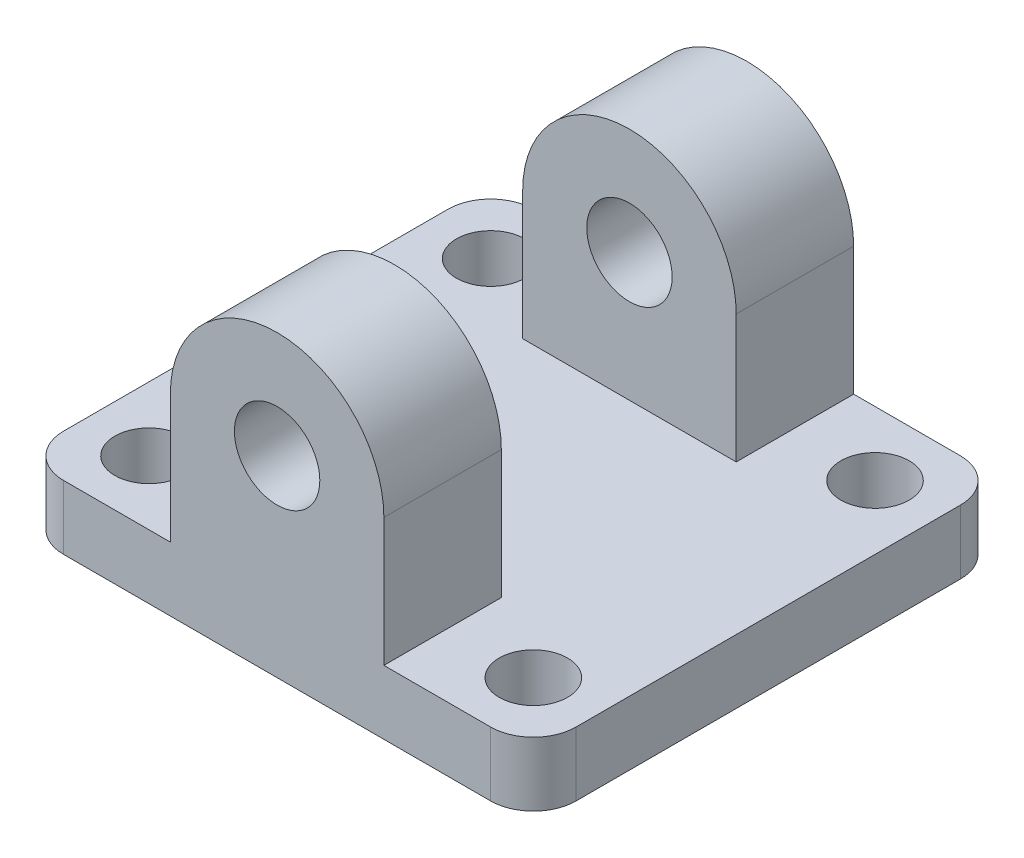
ISO-10303-21;
HEADER;
FILE_DESCRIPTION(('STEP AP214'),'2;1');
FILE_NAME('part.step','',(''),(''),'','','');
FILE_SCHEMA(('AUTOMOTIVE_DESIGN { 1 0 10303 214 1 1 1 1 }'));
ENDSEC;
DATA;
#1=APPLICATION_CONTEXT('core data for automotive mechanical design processes');
#2=APPLICATION_PROTOCOL_DEFINITION('international standard','automotive_design',2000,#1);
#3=PRODUCT_CONTEXT('',#1,'mechanical');
#4=PRODUCT('Part','Part','',(#3));
#5=PRODUCT_RELATED_PRODUCT_CATEGORY('part','',(#4));
#6=PRODUCT_DEFINITION_FORMATION('','',#4);
#7=PRODUCT_DEFINITION_CONTEXT('part definition',#1,'design');
#8=PRODUCT_DEFINITION('design','',#6,#7);
#9=PRODUCT_DEFINITION_SHAPE('','',#8);
#10=(LENGTH_UNIT() NAMED_UNIT(*) SI_UNIT(.MILLI.,.METRE.));
#11=(NAMED_UNIT(*) PLANE_ANGLE_UNIT() SI_UNIT($,.RADIAN.));
#12=(NAMED_UNIT(*) SI_UNIT($,.STERADIAN.) SOLID_ANGLE_UNIT());
#13=UNCERTAINTY_MEASURE_WITH_UNIT(LENGTH_MEASURE(1.E-05),#10,'distance_accuracy_value','');
#14=(GEOMETRIC_REPRESENTATION_CONTEXT(3) GLOBAL_UNCERTAINTY_ASSIGNED_CONTEXT((#13)) GLOBAL_UNIT_ASSIGNED_CONTEXT((#10,
#11,#12)) REPRESENTATION_CONTEXT('',''));
#15=CARTESIAN_POINT('',(0.,0.,0.));
#16=DIRECTION('',(0.,0.,1.));
#17=DIRECTION('',(1.,0.,0.));
#18=AXIS2_PLACEMENT_3D('',#15,#16,#17);
#19=CARTESIAN_POINT('',(5.,3.,22.));
#20=DIRECTION('',(-1.,0.,0.));
#21=DIRECTION('',(0.,-1.,0.));
#22=AXIS2_PLACEMENT_3D('',#19,#20,#21);
#23=PLANE('',#22);
#24=DIRECTION('',(0.,1.,0.));
#25=VECTOR('',#24,1.);
#26=CARTESIAN_POINT('',(5.,3.,5.5));
#27=LINE('',#26,#25);
#28=CARTESIAN_POINT('',(5.,3.,5.5));
#29=VERTEX_POINT('',#28);
#30=CARTESIAN_POINT('',(5.,9.,5.5));
#31=VERTEX_POINT('',#30);
#32=EDGE_CURVE('E237',#29,#31,#27,.T.);
#33=ORIENTED_EDGE('',*,*,#32,.F.);
#34=DIRECTION('',(0.,0.,-1.));
#35=VECTOR('',#34,1.);
#36=CARTESIAN_POINT('',(5.,3.,22.));
#37=LINE('',#36,#35);
#38=CARTESIAN_POINT('',(5.,3.,0.));
#39=VERTEX_POINT('',#38);
#40=EDGE_CURVE('E177',#29,#39,#37,.T.);
#41=ORIENTED_EDGE('',*,*,#40,.T.);
#42=DIRECTION('',(0.,1.,0.));
#43=VECTOR('',#42,1.);
#44=CARTESIAN_POINT('',(5.,3.,0.));
#45=LINE('',#44,#43);
#46=CARTESIAN_POINT('',(5.,9.,0.));
#47=VERTEX_POINT('',#46);
#48=EDGE_CURVE('E277',#39,#47,#45,.T.);
#49=ORIENTED_EDGE('',*,*,#48,.T.);
#50=DIRECTION('',(0.,0.,-1.));
#51=VECTOR('',#50,1.);
#52=CARTESIAN_POINT('',(5.,9.,22.));
#53=LINE('',#52,#51);
#54=EDGE_CURVE('E261',#31,#47,#53,.T.);
#55=ORIENTED_EDGE('',*,*,#54,.F.);
#56=EDGE_LOOP('',(#33,#41,#49,#55));
#57=FACE_BOUND('',#56,.T.);
#58=ADVANCED_FACE('F34',(#57),#23,.F.);
#59=CARTESIAN_POINT('',(0.,9.,22.));
#60=DIRECTION('',(0.,0.,-1.));
#61=DIRECTION('',(-1.,0.,0.));
#62=AXIS2_PLACEMENT_3D('',#59,#60,#61);
#63=CYLINDRICAL_SURFACE('',#62,5.);
#64=DIRECTION('',(0.,0.,-1.));
#65=VECTOR('',#64,1.);
#66=CARTESIAN_POINT('',(-5.,9.,22.));
#67=LINE('',#66,#65);
#68=CARTESIAN_POINT('',(-5.,9.,5.5));
#69=VERTEX_POINT('',#68);
#70=CARTESIAN_POINT('',(-5.,9.,0.));
#71=VERTEX_POINT('',#70);
#72=EDGE_CURVE('E258',#69,#71,#67,.T.);
#73=ORIENTED_EDGE('',*,*,#72,.F.);
#74=CARTESIAN_POINT('',(0.,9.,5.5));
#75=DIRECTION('',(0.,0.,1.));
#76=DIRECTION('',(0.,-1.,0.));
#77=AXIS2_PLACEMENT_3D('',#74,#75,#76);
#78=CIRCLE('',#77,5.);
#79=EDGE_CURVE('E290',#31,#69,#78,.T.);
#80=ORIENTED_EDGE('',*,*,#79,.F.);
#81=ORIENTED_EDGE('',*,*,#54,.T.);
#82=CARTESIAN_POINT('',(0.,9.,0.));
#83=DIRECTION('',(0.,0.,1.));
#84=DIRECTION('',(1.,0.,0.));
#85=AXIS2_PLACEMENT_3D('',#82,#83,#84);
#86=CIRCLE('',#85,5.);
#87=EDGE_CURVE('E252',#47,#71,#86,.T.);
#88=ORIENTED_EDGE('',*,*,#87,.T.);
#89=EDGE_LOOP('',(#73,#80,#81,#88));
#90=FACE_BOUND('',#89,.T.);
#91=ADVANCED_FACE('F273',(#90),#63,.T.);
#92=CARTESIAN_POINT('',(-5.,9.,22.));
#93=DIRECTION('',(1.,0.,0.));
#94=DIRECTION('',(0.,1.,0.));
#95=AXIS2_PLACEMENT_3D('',#92,#93,#94);
#96=PLANE('',#95);
#97=DIRECTION('',(0.,-1.,0.));
#98=VECTOR('',#97,1.);
#99=CARTESIAN_POINT('',(-5.,9.,5.5));
#100=LINE('',#99,#98);
#101=CARTESIAN_POINT('',(-5.,3.,5.5));
#102=VERTEX_POINT('',#101);
#103=EDGE_CURVE('E158',#69,#102,#100,.T.);
#104=ORIENTED_EDGE('',*,*,#103,.F.);
#105=ORIENTED_EDGE('',*,*,#72,.T.);
#106=DIRECTION('',(0.,-1.,0.));
#107=VECTOR('',#106,1.);
#108=CARTESIAN_POINT('',(-5.,9.,0.));
#109=LINE('',#108,#107);
#110=CARTESIAN_POINT('',(-5.,3.,0.));
#111=VERTEX_POINT('',#110);
#112=EDGE_CURVE('E247',#71,#111,#109,.T.);
#113=ORIENTED_EDGE('',*,*,#112,.T.);
#114=DIRECTION('',(0.,0.,-1.));
#115=VECTOR('',#114,1.);
#116=CARTESIAN_POINT('',(-5.,3.,22.));
#117=LINE('',#116,#115);
#118=EDGE_CURVE('E243',#102,#111,#117,.T.);
#119=ORIENTED_EDGE('',*,*,#118,.F.);
#120=EDGE_LOOP('',(#104,#105,#113,#119));
#121=FACE_BOUND('',#120,.T.);
#122=ADVANCED_FACE('F269',(#121),#96,.F.);
#123=CARTESIAN_POINT('',(-12.,2.99999999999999,22.));
#124=DIRECTION('',(1.,0.,0.));
#125=DIRECTION('',(0.,0.,-1.));
#126=AXIS2_PLACEMENT_3D('',#123,#124,#125);
#127=PLANE('',#126);
#128=DIRECTION('',(0.,0.,-1.));
#129=VECTOR('',#128,1.);
#130=CARTESIAN_POINT('',(-12.,0.,22.));
#131=LINE('',#130,#129);
#132=CARTESIAN_POINT('',(-12.,0.,20.));
#133=VERTEX_POINT('',#132);
#134=CARTESIAN_POINT('',(-12.,0.,2.));
#135=VERTEX_POINT('',#134);
#136=EDGE_CURVE('E188',#133,#135,#131,.T.);
#137=ORIENTED_EDGE('',*,*,#136,.F.);
#138=DIRECTION('',(0.,-1.,0.));
#139=VECTOR('',#138,1.);
#140=CARTESIAN_POINT('',(-12.,2.99999999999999,20.));
#141=LINE('',#140,#139);
#142=CARTESIAN_POINT('',(-12.,2.99999999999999,20.));
#143=VERTEX_POINT('',#142);
#144=EDGE_CURVE('E11',#133,#143,#141,.F.);
#145=ORIENTED_EDGE('',*,*,#144,.T.);
#146=DIRECTION('',(0.,0.,-1.));
#147=VECTOR('',#146,1.);
#148=CARTESIAN_POINT('',(-12.,2.99999999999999,22.));
#149=LINE('',#148,#147);
#150=CARTESIAN_POINT('',(-12.,2.99999999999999,2.));
#151=VERTEX_POINT('',#150);
#152=EDGE_CURVE('E223',#143,#151,#149,.T.);
#153=ORIENTED_EDGE('',*,*,#152,.T.);
#154=DIRECTION('',(0.,-1.,0.));
#155=VECTOR('',#154,1.);
#156=CARTESIAN_POINT('',(-12.,2.99999999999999,2.));
#157=LINE('',#156,#155);
#158=EDGE_CURVE('E42',#151,#135,#157,.T.);
#159=ORIENTED_EDGE('',*,*,#158,.T.);
#160=EDGE_LOOP('',(#137,#145,#153,#159));
#161=FACE_BOUND('',#160,.T.);
#162=ADVANCED_FACE('F220',(#161),#127,.F.);
#163=CARTESIAN_POINT('',(-12.,0.,22.));
#164=DIRECTION('',(0.,1.,0.));
#165=DIRECTION('',(-1.,0.,0.));
#166=AXIS2_PLACEMENT_3D('',#163,#164,#165);
#167=PLANE('',#166);
#168=CARTESIAN_POINT('',(-9.,0.,3.));
#169=DIRECTION('',(0.,1.,0.));
#170=DIRECTION('',(0.,0.,1.));
#171=AXIS2_PLACEMENT_3D('',#168,#169,#170);
#172=CIRCLE('',#171,1.6);
#173=CARTESIAN_POINT('',(-9.,0.,4.6));
#174=VERTEX_POINT('',#173);
#175=EDGE_CURVE('E326',#174,#174,#172,.T.);
#176=ORIENTED_EDGE('',*,*,#175,.T.);
#177=EDGE_LOOP('',(#176));
#178=FACE_BOUND('',#177,.T.);
#179=CARTESIAN_POINT('',(-9.,0.,19.));
#180=DIRECTION('',(0.,1.,0.));
#181=DIRECTION('',(0.,0.,1.));
#182=AXIS2_PLACEMENT_3D('',#179,#180,#181);
#183=CIRCLE('',#182,1.6);
#184=CARTESIAN_POINT('',(-9.,0.,20.6));
#185=VERTEX_POINT('',#184);
#186=EDGE_CURVE('E320',#185,#185,#183,.T.);
#187=ORIENTED_EDGE('',*,*,#186,.T.);
#188=EDGE_LOOP('',(#187));
#189=FACE_BOUND('',#188,.T.);
#190=CARTESIAN_POINT('',(9.00000000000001,0.,3.));
#191=DIRECTION('',(0.,1.,0.));
#192=DIRECTION('',(0.,0.,1.));
#193=AXIS2_PLACEMENT_3D('',#190,#191,#192);
#194=CIRCLE('',#193,1.6);
#195=CARTESIAN_POINT('',(9.00000000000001,0.,4.6));
#196=VERTEX_POINT('',#195);
#197=EDGE_CURVE('E314',#196,#196,#194,.T.);
#198=ORIENTED_EDGE('',*,*,#197,.T.);
#199=EDGE_LOOP('',(#198));
#200=FACE_BOUND('',#199,.T.);
#201=CARTESIAN_POINT('',(9.,0.,19.));
#202=DIRECTION('',(0.,1.,0.));
#203=DIRECTION('',(0.,0.,1.));
#204=AXIS2_PLACEMENT_3D('',#201,#202,#203);
#205=CIRCLE('',#204,1.6);
#206=CARTESIAN_POINT('',(9.,0.,20.6));
#207=VERTEX_POINT('',#206);
#208=EDGE_CURVE('E308',#207,#207,#205,.T.);
#209=ORIENTED_EDGE('',*,*,#208,.T.);
#210=EDGE_LOOP('',(#209));
#211=FACE_BOUND('',#210,.T.);
#212=DIRECTION('',(1.,0.,0.));
#213=VECTOR('',#212,1.);
#214=CARTESIAN_POINT('',(-12.,0.,0.));
#215=LINE('',#214,#213);
#216=CARTESIAN_POINT('',(-10.,0.,0.));
#217=VERTEX_POINT('',#216);
#218=CARTESIAN_POINT('',(10.,0.,0.));
#219=VERTEX_POINT('',#218);
#220=EDGE_CURVE('E228',#217,#219,#215,.T.);
#221=ORIENTED_EDGE('',*,*,#220,.T.);
#222=CARTESIAN_POINT('',(10.,0.,2.));
#223=DIRECTION('',(0.,1.,0.));
#224=DIRECTION('',(-1.,0.,0.));
#225=AXIS2_PLACEMENT_3D('',#222,#223,#224);
#226=CIRCLE('',#225,2.);
#227=CARTESIAN_POINT('',(12.,0.,2.));
#228=VERTEX_POINT('',#227);
#229=EDGE_CURVE('E211',#219,#228,#226,.F.);
#230=ORIENTED_EDGE('',*,*,#229,.T.);
#231=DIRECTION('',(0.,0.,-1.));
#232=VECTOR('',#231,1.);
#233=CARTESIAN_POINT('',(12.,0.,22.));
#234=LINE('',#233,#232);
#235=CARTESIAN_POINT('',(12.,0.,20.));
#236=VERTEX_POINT('',#235);
#237=EDGE_CURVE('E179',#236,#228,#234,.T.);
#238=ORIENTED_EDGE('',*,*,#237,.F.);
#239=CARTESIAN_POINT('',(10.,0.,20.));
#240=DIRECTION('',(0.,1.,0.));
#241=DIRECTION('',(-1.,0.,0.));
#242=AXIS2_PLACEMENT_3D('',#239,#240,#241);
#243=CIRCLE('',#242,2.);
#244=CARTESIAN_POINT('',(10.,0.,22.));
#245=VERTEX_POINT('',#244);
#246=EDGE_CURVE('E209',#236,#245,#243,.F.);
#247=ORIENTED_EDGE('',*,*,#246,.T.);
#248=DIRECTION('',(1.,0.,0.));
#249=VECTOR('',#248,1.);
#250=CARTESIAN_POINT('',(-12.,0.,22.));
#251=LINE('',#250,#249);
#252=CARTESIAN_POINT('',(-10.,0.,22.));
#253=VERTEX_POINT('',#252);
#254=EDGE_CURVE('E246',#253,#245,#251,.T.);
#255=ORIENTED_EDGE('',*,*,#254,.F.);
#256=CARTESIAN_POINT('',(-10.,0.,20.));
#257=DIRECTION('',(0.,1.,0.));
#258=DIRECTION('',(-1.,0.,0.));
#259=AXIS2_PLACEMENT_3D('',#256,#257,#258);
#260=CIRCLE('',#259,2.);
#261=EDGE_CURVE('E57',#253,#133,#260,.F.);
#262=ORIENTED_EDGE('',*,*,#261,.T.);
#263=ORIENTED_EDGE('',*,*,#136,.T.);
#264=CARTESIAN_POINT('',(-10.,0.,2.));
#265=DIRECTION('',(0.,1.,0.));
#266=DIRECTION('',(-1.,0.,0.));
#267=AXIS2_PLACEMENT_3D('',#264,#265,#266);
#268=CIRCLE('',#267,2.);
#269=EDGE_CURVE('E49',#135,#217,#268,.F.);
#270=ORIENTED_EDGE('',*,*,#269,.T.);
#271=EDGE_LOOP('',(#221,#230,#238,#247,#255,#262,#263,#270));
#272=FACE_BOUND('',#271,.T.);
#273=ADVANCED_FACE('F226',(#178,#189,#200,#211,#272),#167,.F.);
#274=CARTESIAN_POINT('',(12.,0.,22.));
#275=DIRECTION('',(-1.,0.,0.));
#276=DIRECTION('',(0.,0.,1.));
#277=AXIS2_PLACEMENT_3D('',#274,#275,#276);
#278=PLANE('',#277);
#279=ORIENTED_EDGE('',*,*,#237,.T.);
#280=DIRECTION('',(0.,1.,0.));
#281=VECTOR('',#280,1.);
#282=CARTESIAN_POINT('',(12.,0.,2.));
#283=LINE('',#282,#281);
#284=CARTESIAN_POINT('',(12.,2.99999999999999,2.));
#285=VERTEX_POINT('',#284);
#286=EDGE_CURVE('E192',#228,#285,#283,.T.);
#287=ORIENTED_EDGE('',*,*,#286,.T.);
#288=DIRECTION('',(0.,0.,-1.));
#289=VECTOR('',#288,1.);
#290=CARTESIAN_POINT('',(12.,2.99999999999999,22.));
#291=LINE('',#290,#289);
#292=CARTESIAN_POINT('',(12.,2.99999999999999,20.));
#293=VERTEX_POINT('',#292);
#294=EDGE_CURVE('E176',#293,#285,#291,.T.);
#295=ORIENTED_EDGE('',*,*,#294,.F.);
#296=DIRECTION('',(0.,1.,0.));
#297=VECTOR('',#296,1.);
#298=CARTESIAN_POINT('',(12.,0.,20.));
#299=LINE('',#298,#297);
#300=EDGE_CURVE('E190',#293,#236,#299,.F.);
#301=ORIENTED_EDGE('',*,*,#300,.T.);
#302=EDGE_LOOP('',(#279,#287,#295,#301));
#303=FACE_BOUND('',#302,.T.);
#304=ADVANCED_FACE('F374',(#303),#278,.F.);
#305=CARTESIAN_POINT('',(5.,3.,22.));
#306=VERTEX_POINT('',#305);
#307=CARTESIAN_POINT('',(5.,3.,16.5));
#308=VERTEX_POINT('',#307);
#309=EDGE_CURVE('E166',#306,#308,#37,.T.);
#310=ORIENTED_EDGE('',*,*,#309,.T.);
#311=DIRECTION('',(0.,1.,0.));
#312=VECTOR('',#311,1.);
#313=CARTESIAN_POINT('',(5.,3.,16.5));
#314=LINE('',#313,#312);
#315=CARTESIAN_POINT('',(5.,9.,16.5));
#316=VERTEX_POINT('',#315);
#317=EDGE_CURVE('E147',#308,#316,#314,.T.);
#318=ORIENTED_EDGE('',*,*,#317,.T.);
#319=CARTESIAN_POINT('',(5.,9.,22.));
#320=VERTEX_POINT('',#319);
#321=EDGE_CURVE('E182',#320,#316,#53,.T.);
#322=ORIENTED_EDGE('',*,*,#321,.F.);
#323=DIRECTION('',(0.,1.,0.));
#324=VECTOR('',#323,1.);
#325=CARTESIAN_POINT('',(5.,3.,22.));
#326=LINE('',#325,#324);
#327=EDGE_CURVE('E175',#306,#320,#326,.T.);
#328=ORIENTED_EDGE('',*,*,#327,.F.);
#329=EDGE_LOOP('',(#310,#318,#322,#328));
#330=FACE_BOUND('',#329,.T.);
#331=ADVANCED_FACE('F174',(#330),#23,.F.);
#332=CARTESIAN_POINT('',(0.,9.,16.5));
#333=DIRECTION('',(0.,0.,1.));
#334=DIRECTION('',(0.,-1.,0.));
#335=AXIS2_PLACEMENT_3D('',#332,#333,#334);
#336=CIRCLE('',#335,5.);
#337=CARTESIAN_POINT('',(-5.,9.,16.5));
#338=VERTEX_POINT('',#337);
#339=EDGE_CURVE('E153',#316,#338,#336,.T.);
#340=ORIENTED_EDGE('',*,*,#339,.T.);
#341=CARTESIAN_POINT('',(-5.,9.,22.));
#342=VERTEX_POINT('',#341);
#343=EDGE_CURVE('E259',#342,#338,#67,.T.);
#344=ORIENTED_EDGE('',*,*,#343,.F.);
#345=CARTESIAN_POINT('',(0.,9.,22.));
#346=DIRECTION('',(0.,0.,1.));
#347=DIRECTION('',(1.,0.,0.));
#348=AXIS2_PLACEMENT_3D('',#345,#346,#347);
#349=CIRCLE('',#348,5.);
#350=EDGE_CURVE('E285',#320,#342,#349,.T.);
#351=ORIENTED_EDGE('',*,*,#350,.F.);
#352=ORIENTED_EDGE('',*,*,#321,.T.);
#353=EDGE_LOOP('',(#340,#344,#351,#352));
#354=FACE_BOUND('',#353,.T.);
#355=ADVANCED_FACE('F370',(#354),#63,.T.);
#356=ORIENTED_EDGE('',*,*,#343,.T.);
#357=DIRECTION('',(0.,-1.,0.));
#358=VECTOR('',#357,1.);
#359=CARTESIAN_POINT('',(-5.,9.,16.5));
#360=LINE('',#359,#358);
#361=CARTESIAN_POINT('',(-5.,3.,16.5));
#362=VERTEX_POINT('',#361);
#363=EDGE_CURVE('E294',#338,#362,#360,.T.);
#364=ORIENTED_EDGE('',*,*,#363,.T.);
#365=CARTESIAN_POINT('',(-5.,3.,22.));
#366=VERTEX_POINT('',#365);
#367=EDGE_CURVE('E170',#366,#362,#117,.T.);
#368=ORIENTED_EDGE('',*,*,#367,.F.);
#369=DIRECTION('',(0.,-1.,0.));
#370=VECTOR('',#369,1.);
#371=CARTESIAN_POINT('',(-5.,9.,22.));
#372=LINE('',#371,#370);
#373=EDGE_CURVE('E283',#342,#366,#372,.T.);
#374=ORIENTED_EDGE('',*,*,#373,.F.);
#375=EDGE_LOOP('',(#356,#364,#368,#374));
#376=FACE_BOUND('',#375,.T.);
#377=ADVANCED_FACE('F338',(#376),#96,.F.);
#378=CARTESIAN_POINT('',(-5.,3.,22.));
#379=DIRECTION('',(0.,-1.,0.));
#380=DIRECTION('',(1.,0.,0.));
#381=AXIS2_PLACEMENT_3D('',#378,#379,#380);
#382=PLANE('',#381);
#383=CARTESIAN_POINT('',(-9.,3.,3.));
#384=DIRECTION('',(0.,1.,0.));
#385=DIRECTION('',(0.,0.,1.));
#386=AXIS2_PLACEMENT_3D('',#383,#384,#385);
#387=CIRCLE('',#386,1.6);
#388=CARTESIAN_POINT('',(-9.,3.,4.6));
#389=VERTEX_POINT('',#388);
#390=EDGE_CURVE('E329',#389,#389,#387,.T.);
#391=ORIENTED_EDGE('',*,*,#390,.F.);
#392=EDGE_LOOP('',(#391));
#393=FACE_BOUND('',#392,.T.);
#394=CARTESIAN_POINT('',(-9.,3.,19.));
#395=DIRECTION('',(0.,1.,0.));
#396=DIRECTION('',(0.,0.,1.));
#397=AXIS2_PLACEMENT_3D('',#394,#395,#396);
#398=CIRCLE('',#397,1.6);
#399=CARTESIAN_POINT('',(-9.,3.,20.6));
#400=VERTEX_POINT('',#399);
#401=EDGE_CURVE('E323',#400,#400,#398,.T.);
#402=ORIENTED_EDGE('',*,*,#401,.F.);
#403=EDGE_LOOP('',(#402));
#404=FACE_BOUND('',#403,.T.);
#405=CARTESIAN_POINT('',(9.00000000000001,3.00000000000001,3.));
#406=DIRECTION('',(0.,1.,0.));
#407=DIRECTION('',(0.,0.,1.));
#408=AXIS2_PLACEMENT_3D('',#405,#406,#407);
#409=CIRCLE('',#408,1.6);
#410=CARTESIAN_POINT('',(9.00000000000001,3.00000000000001,4.6));
#411=VERTEX_POINT('',#410);
#412=EDGE_CURVE('E317',#411,#411,#409,.T.);
#413=ORIENTED_EDGE('',*,*,#412,.F.);
#414=EDGE_LOOP('',(#413));
#415=FACE_BOUND('',#414,.T.);
#416=CARTESIAN_POINT('',(9.,3.00000000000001,19.));
#417=DIRECTION('',(0.,1.,0.));
#418=DIRECTION('',(0.,0.,1.));
#419=AXIS2_PLACEMENT_3D('',#416,#417,#418);
#420=CIRCLE('',#419,1.6);
#421=CARTESIAN_POINT('',(9.,3.00000000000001,20.6));
#422=VERTEX_POINT('',#421);
#423=EDGE_CURVE('E311',#422,#422,#420,.T.);
#424=ORIENTED_EDGE('',*,*,#423,.F.);
#425=EDGE_LOOP('',(#424));
#426=FACE_BOUND('',#425,.T.);
#427=ORIENTED_EDGE('',*,*,#294,.T.);
#428=CARTESIAN_POINT('',(10.,3.00000000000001,2.));
#429=DIRECTION('',(0.,-1.,0.));
#430=DIRECTION('',(1.,0.,0.));
#431=AXIS2_PLACEMENT_3D('',#428,#429,#430);
#432=CIRCLE('',#431,2.);
#433=CARTESIAN_POINT('',(10.,3.,0.));
#434=VERTEX_POINT('',#433);
#435=EDGE_CURVE('E201',#285,#434,#432,.F.);
#436=ORIENTED_EDGE('',*,*,#435,.T.);
#437=DIRECTION('',(-1.,0.,0.));
#438=VECTOR('',#437,1.);
#439=CARTESIAN_POINT('',(12.,2.99999999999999,0.));
#440=LINE('',#439,#438);
#441=EDGE_CURVE('E236',#434,#39,#440,.T.);
#442=ORIENTED_EDGE('',*,*,#441,.T.);
#443=ORIENTED_EDGE('',*,*,#40,.F.);
#444=DIRECTION('',(1.,0.,0.));
#445=VECTOR('',#444,1.);
#446=CARTESIAN_POINT('',(-8.,3.,5.5));
#447=LINE('',#446,#445);
#448=EDGE_CURVE('E171',#102,#29,#447,.T.);
#449=ORIENTED_EDGE('',*,*,#448,.F.);
#450=ORIENTED_EDGE('',*,*,#118,.T.);
#451=DIRECTION('',(-1.,0.,0.));
#452=VECTOR('',#451,1.);
#453=CARTESIAN_POINT('',(-5.,3.,0.));
#454=LINE('',#453,#452);
#455=CARTESIAN_POINT('',(-10.,3.,0.));
#456=VERTEX_POINT('',#455);
#457=EDGE_CURVE('E240',#111,#456,#454,.T.);
#458=ORIENTED_EDGE('',*,*,#457,.T.);
#459=CARTESIAN_POINT('',(-10.,3.,2.));
#460=DIRECTION('',(0.,-1.,0.));
#461=DIRECTION('',(1.,0.,0.));
#462=AXIS2_PLACEMENT_3D('',#459,#460,#461);
#463=CIRCLE('',#462,2.);
#464=EDGE_CURVE('E195',#456,#151,#463,.F.);
#465=ORIENTED_EDGE('',*,*,#464,.T.);
#466=ORIENTED_EDGE('',*,*,#152,.F.);
#467=CARTESIAN_POINT('',(-10.,3.,20.));
#468=DIRECTION('',(0.,-1.,0.));
#469=DIRECTION('',(1.,0.,0.));
#470=AXIS2_PLACEMENT_3D('',#467,#468,#469);
#471=CIRCLE('',#470,2.);
#472=CARTESIAN_POINT('',(-10.,3.,22.));
#473=VERTEX_POINT('',#472);
#474=EDGE_CURVE('E197',#143,#473,#471,.F.);
#475=ORIENTED_EDGE('',*,*,#474,.T.);
#476=DIRECTION('',(-1.,0.,0.));
#477=VECTOR('',#476,1.);
#478=CARTESIAN_POINT('',(-5.,3.,22.));
#479=LINE('',#478,#477);
#480=EDGE_CURVE('E257',#366,#473,#479,.T.);
#481=ORIENTED_EDGE('',*,*,#480,.F.);
#482=ORIENTED_EDGE('',*,*,#367,.T.);
#483=DIRECTION('',(1.,0.,0.));
#484=VECTOR('',#483,1.);
#485=CARTESIAN_POINT('',(-8.,3.,16.5));
#486=LINE('',#485,#484);
#487=EDGE_CURVE('E151',#362,#308,#486,.T.);
#488=ORIENTED_EDGE('',*,*,#487,.T.);
#489=ORIENTED_EDGE('',*,*,#309,.F.);
#490=DIRECTION('',(-1.,0.,0.));
#491=VECTOR('',#490,1.);
#492=CARTESIAN_POINT('',(12.,2.99999999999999,22.));
#493=LINE('',#492,#491);
#494=CARTESIAN_POINT('',(10.,3.,22.));
#495=VERTEX_POINT('',#494);
#496=EDGE_CURVE('E250',#495,#306,#493,.T.);
#497=ORIENTED_EDGE('',*,*,#496,.F.);
#498=CARTESIAN_POINT('',(10.,3.00000000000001,20.));
#499=DIRECTION('',(0.,-1.,0.));
#500=DIRECTION('',(1.,0.,0.));
#501=AXIS2_PLACEMENT_3D('',#498,#499,#500);
#502=CIRCLE('',#501,2.);
#503=EDGE_CURVE('E199',#495,#293,#502,.F.);
#504=ORIENTED_EDGE('',*,*,#503,.T.);
#505=EDGE_LOOP('',(#427,#436,#442,#443,#449,#450,#458,#465,#466,#475,#481,#482,#488,#489,#497,#504));
#506=FACE_BOUND('',#505,.T.);
#507=ADVANCED_FACE('F164',(#393,#404,#415,#426,#506),#382,.F.);
#508=CARTESIAN_POINT('',(0.,9.,22.));
#509=DIRECTION('',(0.,0.,1.));
#510=DIRECTION('',(1.,0.,0.));
#511=AXIS2_PLACEMENT_3D('',#508,#509,#510);
#512=PLANE('',#511);
#513=CARTESIAN_POINT('',(0.,9.,22.));
#514=DIRECTION('',(0.,0.,1.));
#515=DIRECTION('',(1.,0.,0.));
#516=AXIS2_PLACEMENT_3D('',#513,#514,#515);
#517=CIRCLE('',#516,2.);
#518=CARTESIAN_POINT('',(2.,9.,22.));
#519=VERTEX_POINT('',#518);
#520=EDGE_CURVE('E305',#519,#519,#517,.T.);
#521=ORIENTED_EDGE('',*,*,#520,.F.);
#522=EDGE_LOOP('',(#521));
#523=FACE_BOUND('',#522,.T.);
#524=ORIENTED_EDGE('',*,*,#254,.T.);
#525=DIRECTION('',(0.,1.,0.));
#526=VECTOR('',#525,1.);
#527=CARTESIAN_POINT('',(10.,2.99999999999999,22.));
#528=LINE('',#527,#526);
#529=EDGE_CURVE('E216',#245,#495,#528,.T.);
#530=ORIENTED_EDGE('',*,*,#529,.T.);
#531=ORIENTED_EDGE('',*,*,#496,.T.);
#532=ORIENTED_EDGE('',*,*,#327,.T.);
#533=ORIENTED_EDGE('',*,*,#350,.T.);
#534=ORIENTED_EDGE('',*,*,#373,.T.);
#535=ORIENTED_EDGE('',*,*,#480,.T.);
#536=DIRECTION('',(0.,-1.,0.));
#537=VECTOR('',#536,1.);
#538=CARTESIAN_POINT('',(-10.,0.,22.));
#539=LINE('',#538,#537);
#540=EDGE_CURVE('E213',#473,#253,#539,.T.);
#541=ORIENTED_EDGE('',*,*,#540,.T.);
#542=EDGE_LOOP('',(#524,#530,#531,#532,#533,#534,#535,#541));
#543=FACE_BOUND('',#542,.T.);
#544=ADVANCED_FACE('F337',(#523,#543),#512,.T.);
#545=CARTESIAN_POINT('',(0.,9.,0.));
#546=DIRECTION('',(0.,0.,1.));
#547=DIRECTION('',(1.,0.,0.));
#548=AXIS2_PLACEMENT_3D('',#545,#546,#547);
#549=PLANE('',#548);
#550=CARTESIAN_POINT('',(0.,9.,0.));
#551=DIRECTION('',(0.,0.,1.));
#552=DIRECTION('',(1.,0.,0.));
#553=AXIS2_PLACEMENT_3D('',#550,#551,#552);
#554=CIRCLE('',#553,1.99999999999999);
#555=CARTESIAN_POINT('',(1.99999999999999,9.,0.));
#556=VERTEX_POINT('',#555);
#557=EDGE_CURVE('E302',#556,#556,#554,.T.);
#558=ORIENTED_EDGE('',*,*,#557,.T.);
#559=EDGE_LOOP('',(#558));
#560=FACE_BOUND('',#559,.T.);
#561=ORIENTED_EDGE('',*,*,#441,.F.);
#562=DIRECTION('',(0.,1.,0.));
#563=VECTOR('',#562,1.);
#564=CARTESIAN_POINT('',(10.,9.,0.));
#565=LINE('',#564,#563);
#566=EDGE_CURVE('E205',#434,#219,#565,.F.);
#567=ORIENTED_EDGE('',*,*,#566,.T.);
#568=ORIENTED_EDGE('',*,*,#220,.F.);
#569=DIRECTION('',(0.,-1.,0.));
#570=VECTOR('',#569,1.);
#571=CARTESIAN_POINT('',(-10.,9.,0.));
#572=LINE('',#571,#570);
#573=EDGE_CURVE('E203',#217,#456,#572,.F.);
#574=ORIENTED_EDGE('',*,*,#573,.T.);
#575=ORIENTED_EDGE('',*,*,#457,.F.);
#576=ORIENTED_EDGE('',*,*,#112,.F.);
#577=ORIENTED_EDGE('',*,*,#87,.F.);
#578=ORIENTED_EDGE('',*,*,#48,.F.);
#579=EDGE_LOOP('',(#561,#567,#568,#574,#575,#576,#577,#578));
#580=FACE_BOUND('',#579,.T.);
#581=ADVANCED_FACE('F232',(#560,#580),#549,.F.);
#582=CARTESIAN_POINT('',(-8.,14.,5.5));
#583=DIRECTION('',(0.,0.,1.));
#584=DIRECTION('',(0.,-1.,0.));
#585=AXIS2_PLACEMENT_3D('',#582,#583,#584);
#586=PLANE('',#585);
#587=CARTESIAN_POINT('',(0.,9.,5.5));
#588=DIRECTION('',(0.,0.,1.));
#589=DIRECTION('',(0.,-1.,0.));
#590=AXIS2_PLACEMENT_3D('',#587,#588,#589);
#591=CIRCLE('',#590,2.);
#592=CARTESIAN_POINT('',(0.,7.,5.5));
#593=VERTEX_POINT('',#592);
#594=EDGE_CURVE('E172',#593,#593,#591,.T.);
#595=ORIENTED_EDGE('',*,*,#594,.F.);
#596=EDGE_LOOP('',(#595));
#597=FACE_BOUND('',#596,.T.);
#598=ORIENTED_EDGE('',*,*,#32,.T.);
#599=ORIENTED_EDGE('',*,*,#79,.T.);
#600=ORIENTED_EDGE('',*,*,#103,.T.);
#601=ORIENTED_EDGE('',*,*,#448,.T.);
#602=EDGE_LOOP('',(#598,#599,#600,#601));
#603=FACE_BOUND('',#602,.T.);
#604=ADVANCED_FACE('F455',(#597,#603),#586,.T.);
#605=CARTESIAN_POINT('',(-8.,14.,16.5));
#606=DIRECTION('',(0.,0.,1.));
#607=DIRECTION('',(0.,-1.,0.));
#608=AXIS2_PLACEMENT_3D('',#605,#606,#607);
#609=PLANE('',#608);
#610=CARTESIAN_POINT('',(0.,9.,16.5));
#611=DIRECTION('',(0.,0.,1.));
#612=DIRECTION('',(0.,-1.,0.));
#613=AXIS2_PLACEMENT_3D('',#610,#611,#612);
#614=CIRCLE('',#613,2.);
#615=CARTESIAN_POINT('',(0.,7.,16.5));
#616=VERTEX_POINT('',#615);
#617=EDGE_CURVE('E299',#616,#616,#614,.T.);
#618=ORIENTED_EDGE('',*,*,#617,.T.);
#619=EDGE_LOOP('',(#618));
#620=FACE_BOUND('',#619,.T.);
#621=ORIENTED_EDGE('',*,*,#487,.F.);
#622=ORIENTED_EDGE('',*,*,#363,.F.);
#623=ORIENTED_EDGE('',*,*,#339,.F.);
#624=ORIENTED_EDGE('',*,*,#317,.F.);
#625=EDGE_LOOP('',(#621,#622,#623,#624));
#626=FACE_BOUND('',#625,.T.);
#627=ADVANCED_FACE('F149',(#620,#626),#609,.F.);
#628=CARTESIAN_POINT('',(0.,9.,22.));
#629=DIRECTION('',(0.,0.,1.));
#630=DIRECTION('',(1.,0.,0.));
#631=AXIS2_PLACEMENT_3D('',#628,#629,#630);
#632=CYLINDRICAL_SURFACE('',#631,2.);
#633=ORIENTED_EDGE('',*,*,#594,.T.);
#634=EDGE_LOOP('',(#633));
#635=FACE_BOUND('',#634,.T.);
#636=ORIENTED_EDGE('',*,*,#557,.F.);
#637=EDGE_LOOP('',(#636));
#638=FACE_BOUND('',#637,.T.);
#639=ADVANCED_FACE('F359',(#635,#638),#632,.F.);
#640=ORIENTED_EDGE('',*,*,#520,.T.);
#641=EDGE_LOOP('',(#640));
#642=FACE_BOUND('',#641,.T.);
#643=ORIENTED_EDGE('',*,*,#617,.F.);
#644=EDGE_LOOP('',(#643));
#645=FACE_BOUND('',#644,.T.);
#646=ADVANCED_FACE('F349',(#642,#645),#632,.F.);
#647=CARTESIAN_POINT('',(9.,3.00000000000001,19.));
#648=DIRECTION('',(0.,1.,0.));
#649=DIRECTION('',(0.,0.,1.));
#650=AXIS2_PLACEMENT_3D('',#647,#648,#649);
#651=CYLINDRICAL_SURFACE('',#650,1.6);
#652=ORIENTED_EDGE('',*,*,#208,.F.);
#653=EDGE_LOOP('',(#652));
#654=FACE_BOUND('',#653,.T.);
#655=ORIENTED_EDGE('',*,*,#423,.T.);
#656=EDGE_LOOP('',(#655));
#657=FACE_BOUND('',#656,.T.);
#658=ADVANCED_FACE('F346',(#654,#657),#651,.F.);
#659=CARTESIAN_POINT('',(9.00000000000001,3.00000000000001,3.));
#660=DIRECTION('',(0.,1.,0.));
#661=DIRECTION('',(0.,0.,1.));
#662=AXIS2_PLACEMENT_3D('',#659,#660,#661);
#663=CYLINDRICAL_SURFACE('',#662,1.6);
#664=ORIENTED_EDGE('',*,*,#197,.F.);
#665=EDGE_LOOP('',(#664));
#666=FACE_BOUND('',#665,.T.);
#667=ORIENTED_EDGE('',*,*,#412,.T.);
#668=EDGE_LOOP('',(#667));
#669=FACE_BOUND('',#668,.T.);
#670=ADVANCED_FACE('F348',(#666,#669),#663,.F.);
#671=CARTESIAN_POINT('',(-9.,3.,19.));
#672=DIRECTION('',(0.,1.,0.));
#673=DIRECTION('',(0.,0.,1.));
#674=AXIS2_PLACEMENT_3D('',#671,#672,#673);
#675=CYLINDRICAL_SURFACE('',#674,1.6);
#676=ORIENTED_EDGE('',*,*,#186,.F.);
#677=EDGE_LOOP('',(#676));
#678=FACE_BOUND('',#677,.T.);
#679=ORIENTED_EDGE('',*,*,#401,.T.);
#680=EDGE_LOOP('',(#679));
#681=FACE_BOUND('',#680,.T.);
#682=ADVANCED_FACE('F356',(#678,#681),#675,.F.);
#683=CARTESIAN_POINT('',(-9.,3.,3.));
#684=DIRECTION('',(0.,1.,0.));
#685=DIRECTION('',(0.,0.,1.));
#686=AXIS2_PLACEMENT_3D('',#683,#684,#685);
#687=CYLINDRICAL_SURFACE('',#686,1.6);
#688=ORIENTED_EDGE('',*,*,#175,.F.);
#689=EDGE_LOOP('',(#688));
#690=FACE_BOUND('',#689,.T.);
#691=ORIENTED_EDGE('',*,*,#390,.T.);
#692=EDGE_LOOP('',(#691));
#693=FACE_BOUND('',#692,.T.);
#694=ADVANCED_FACE('F333',(#690,#693),#687,.F.);
#695=CARTESIAN_POINT('',(10.,0.,2.));
#696=DIRECTION('',(0.,1.,0.));
#697=DIRECTION('',(0.,0.,1.));
#698=AXIS2_PLACEMENT_3D('',#695,#696,#697);
#699=CYLINDRICAL_SURFACE('',#698,2.);
#700=ORIENTED_EDGE('',*,*,#229,.F.);
#701=ORIENTED_EDGE('',*,*,#566,.F.);
#702=ORIENTED_EDGE('',*,*,#435,.F.);
#703=ORIENTED_EDGE('',*,*,#286,.F.);
#704=EDGE_LOOP('',(#700,#701,#702,#703));
#705=FACE_BOUND('',#704,.T.);
#706=ADVANCED_FACE('F389',(#705),#699,.T.);
#707=CARTESIAN_POINT('',(10.,9.,20.));
#708=DIRECTION('',(0.,-1.,0.));
#709=DIRECTION('',(0.,0.,-1.));
#710=AXIS2_PLACEMENT_3D('',#707,#708,#709);
#711=CYLINDRICAL_SURFACE('',#710,2.);
#712=ORIENTED_EDGE('',*,*,#246,.F.);
#713=ORIENTED_EDGE('',*,*,#300,.F.);
#714=ORIENTED_EDGE('',*,*,#503,.F.);
#715=ORIENTED_EDGE('',*,*,#529,.F.);
#716=EDGE_LOOP('',(#712,#713,#714,#715));
#717=FACE_BOUND('',#716,.T.);
#718=ADVANCED_FACE('F392',(#717),#711,.T.);
#719=CARTESIAN_POINT('',(-10.,9.,20.));
#720=DIRECTION('',(0.,1.,0.));
#721=DIRECTION('',(0.,0.,1.));
#722=AXIS2_PLACEMENT_3D('',#719,#720,#721);
#723=CYLINDRICAL_SURFACE('',#722,2.);
#724=ORIENTED_EDGE('',*,*,#474,.F.);
#725=ORIENTED_EDGE('',*,*,#144,.F.);
#726=ORIENTED_EDGE('',*,*,#261,.F.);
#727=ORIENTED_EDGE('',*,*,#540,.F.);
#728=EDGE_LOOP('',(#724,#725,#726,#727));
#729=FACE_BOUND('',#728,.T.);
#730=ADVANCED_FACE('F395',(#729),#723,.T.);
#731=CARTESIAN_POINT('',(-10.,2.99999999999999,2.));
#732=DIRECTION('',(0.,-1.,0.));
#733=DIRECTION('',(0.,0.,-1.));
#734=AXIS2_PLACEMENT_3D('',#731,#732,#733);
#735=CYLINDRICAL_SURFACE('',#734,2.);
#736=ORIENTED_EDGE('',*,*,#464,.F.);
#737=ORIENTED_EDGE('',*,*,#573,.F.);
#738=ORIENTED_EDGE('',*,*,#269,.F.);
#739=ORIENTED_EDGE('',*,*,#158,.F.);
#740=EDGE_LOOP('',(#736,#737,#738,#739));
#741=FACE_BOUND('',#740,.T.);
#742=ADVANCED_FACE('F36',(#741),#735,.T.);
#743=CLOSED_SHELL('',(#58,#91,#122,#162,#273,#304,#331,#355,#377,#507,#544,#581,#604,#627,#639,
#646,#658,#670,#682,#694,#706,#718,#730,#742));
#744=MANIFOLD_SOLID_BREP('B2',#743);
#745=ADVANCED_BREP_SHAPE_REPRESENTATION('',(#18,#744),#14);
#746=SHAPE_DEFINITION_REPRESENTATION(#9,#745);
ENDSEC;
END-ISO-10303-21;
